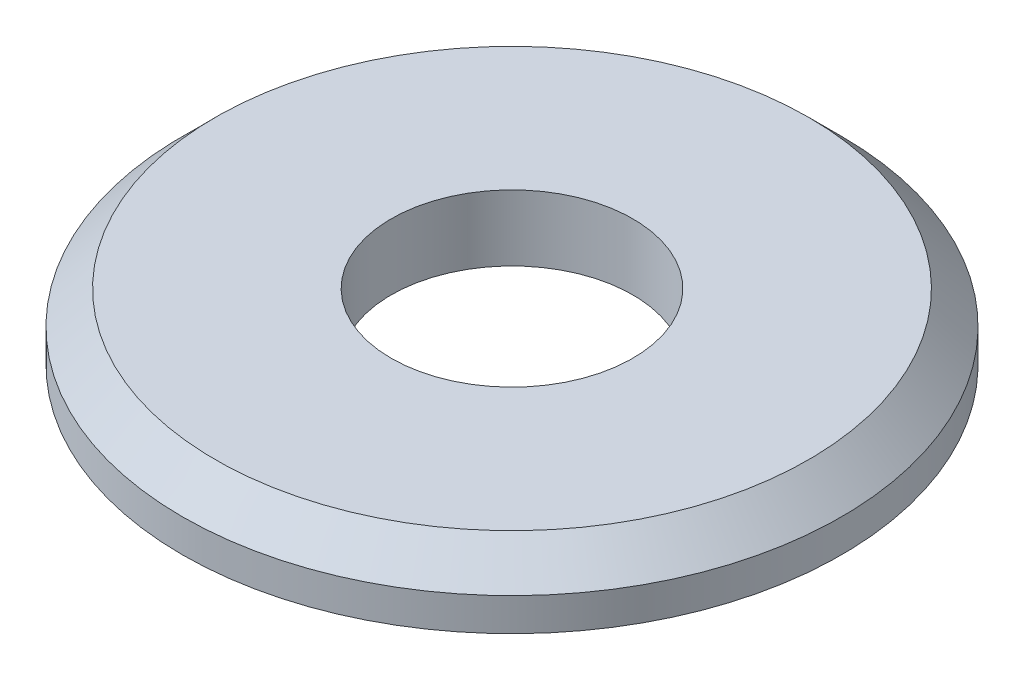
ISO-10303-21;
HEADER;
FILE_DESCRIPTION(('STEP AP214'),'2;1');
FILE_NAME('part.step','',(''),(''),'','','');
FILE_SCHEMA(('AUTOMOTIVE_DESIGN { 1 0 10303 214 1 1 1 1 }'));
ENDSEC;
DATA;
#1=APPLICATION_CONTEXT('core data for automotive mechanical design processes');
#2=APPLICATION_PROTOCOL_DEFINITION('international standard','automotive_design',2000,#1);
#3=PRODUCT_CONTEXT('',#1,'mechanical');
#4=PRODUCT('Part','Part','',(#3));
#5=PRODUCT_RELATED_PRODUCT_CATEGORY('part','',(#4));
#6=PRODUCT_DEFINITION_FORMATION('','',#4);
#7=PRODUCT_DEFINITION_CONTEXT('part definition',#1,'design');
#8=PRODUCT_DEFINITION('design','',#6,#7);
#9=PRODUCT_DEFINITION_SHAPE('','',#8);
#10=(LENGTH_UNIT() NAMED_UNIT(*) SI_UNIT(.MILLI.,.METRE.));
#11=(NAMED_UNIT(*) PLANE_ANGLE_UNIT() SI_UNIT($,.RADIAN.));
#12=(NAMED_UNIT(*) SI_UNIT($,.STERADIAN.) SOLID_ANGLE_UNIT());
#13=UNCERTAINTY_MEASURE_WITH_UNIT(LENGTH_MEASURE(1.E-05),#10,'distance_accuracy_value','');
#14=(GEOMETRIC_REPRESENTATION_CONTEXT(3) GLOBAL_UNCERTAINTY_ASSIGNED_CONTEXT((#13)) GLOBAL_UNIT_ASSIGNED_CONTEXT((#10,
#11,#12)) REPRESENTATION_CONTEXT('',''));
#15=CARTESIAN_POINT('',(0.,0.,0.));
#16=DIRECTION('',(0.,0.,1.));
#17=DIRECTION('',(1.,0.,0.));
#18=AXIS2_PLACEMENT_3D('',#15,#16,#17);
#19=CARTESIAN_POINT('',(0.,0.3,0.));
#20=DIRECTION('',(0.,1.,0.));
#21=DIRECTION('',(0.,0.,1.));
#22=AXIS2_PLACEMENT_3D('',#19,#20,#21);
#23=PLANE('',#22);
#24=CARTESIAN_POINT('',(0.,0.3,0.));
#25=DIRECTION('',(0.,1.,0.));
#26=DIRECTION('',(0.,0.,1.));
#27=AXIS2_PLACEMENT_3D('',#24,#25,#26);
#28=CIRCLE('',#27,1.35);
#29=CARTESIAN_POINT('',(0.,0.3,-1.35));
#30=VERTEX_POINT('',#29);
#31=EDGE_CURVE('E35',#30,#30,#28,.T.);
#32=ORIENTED_EDGE('',*,*,#31,.T.);
#33=EDGE_LOOP('',(#32));
#34=FACE_BOUND('',#33,.T.);
#35=CARTESIAN_POINT('',(0.,0.3,0.));
#36=DIRECTION('',(0.,1.,0.));
#37=DIRECTION('',(0.,0.,1.));
#38=AXIS2_PLACEMENT_3D('',#35,#36,#37);
#39=CIRCLE('',#38,0.55);
#40=CARTESIAN_POINT('',(0.,0.3,0.55));
#41=VERTEX_POINT('',#40);
#42=EDGE_CURVE('E43',#41,#41,#39,.T.);
#43=ORIENTED_EDGE('',*,*,#42,.F.);
#44=EDGE_LOOP('',(#43));
#45=FACE_BOUND('',#44,.T.);
#46=ADVANCED_FACE('F28',(#34,#45),#23,.T.);
#47=CARTESIAN_POINT('',(0.,0.,0.));
#48=DIRECTION('',(0.,1.,0.));
#49=DIRECTION('',(0.,0.,1.));
#50=AXIS2_PLACEMENT_3D('',#47,#48,#49);
#51=PLANE('',#50);
#52=CARTESIAN_POINT('',(0.,0.,0.));
#53=DIRECTION('',(0.,1.,0.));
#54=DIRECTION('',(0.,0.,1.));
#55=AXIS2_PLACEMENT_3D('',#52,#53,#54);
#56=CIRCLE('',#55,1.5);
#57=CARTESIAN_POINT('',(0.,0.,1.5));
#58=VERTEX_POINT('',#57);
#59=EDGE_CURVE('E39',#58,#58,#56,.T.);
#60=ORIENTED_EDGE('',*,*,#59,.F.);
#61=EDGE_LOOP('',(#60));
#62=FACE_BOUND('',#61,.T.);
#63=CARTESIAN_POINT('',(0.,0.,0.));
#64=DIRECTION('',(0.,1.,0.));
#65=DIRECTION('',(0.,0.,1.));
#66=AXIS2_PLACEMENT_3D('',#63,#64,#65);
#67=CIRCLE('',#66,0.55);
#68=CARTESIAN_POINT('',(0.,0.,0.55));
#69=VERTEX_POINT('',#68);
#70=EDGE_CURVE('E48',#69,#69,#67,.T.);
#71=ORIENTED_EDGE('',*,*,#70,.T.);
#72=EDGE_LOOP('',(#71));
#73=FACE_BOUND('',#72,.T.);
#74=ADVANCED_FACE('F52',(#62,#73),#51,.F.);
#75=CARTESIAN_POINT('',(0.,0.3,0.));
#76=DIRECTION('',(0.,-1.,0.));
#77=DIRECTION('',(0.,0.,-1.));
#78=AXIS2_PLACEMENT_3D('',#75,#76,#77);
#79=CYLINDRICAL_SURFACE('',#78,1.5);
#80=CARTESIAN_POINT('',(0.,0.150000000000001,0.));
#81=DIRECTION('',(0.,1.,0.));
#82=DIRECTION('',(0.,0.,1.));
#83=AXIS2_PLACEMENT_3D('',#80,#81,#82);
#84=CIRCLE('',#83,1.5);
#85=CARTESIAN_POINT('',(0.,0.150000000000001,-1.5));
#86=VERTEX_POINT('',#85);
#87=EDGE_CURVE('E10',#86,#86,#84,.F.);
#88=ORIENTED_EDGE('',*,*,#87,.T.);
#89=EDGE_LOOP('',(#88));
#90=FACE_BOUND('',#89,.T.);
#91=ORIENTED_EDGE('',*,*,#59,.T.);
#92=EDGE_LOOP('',(#91));
#93=FACE_BOUND('',#92,.T.);
#94=ADVANCED_FACE('F30',(#90,#93),#79,.T.);
#95=CARTESIAN_POINT('',(0.,0.3,0.));
#96=DIRECTION('',(0.,-1.,0.));
#97=DIRECTION('',(0.,0.,-1.));
#98=AXIS2_PLACEMENT_3D('',#95,#96,#97);
#99=CYLINDRICAL_SURFACE('',#98,0.55);
#100=ORIENTED_EDGE('',*,*,#42,.T.);
#101=EDGE_LOOP('',(#100));
#102=FACE_BOUND('',#101,.T.);
#103=ORIENTED_EDGE('',*,*,#70,.F.);
#104=EDGE_LOOP('',(#103));
#105=FACE_BOUND('',#104,.T.);
#106=ADVANCED_FACE('F54',(#102,#105),#99,.F.);
#107=CARTESIAN_POINT('',(0.,0.3,0.));
#108=DIRECTION('',(0.,-1.,0.));
#109=DIRECTION('',(0.,0.,-1.));
#110=AXIS2_PLACEMENT_3D('',#107,#108,#109);
#111=CONICAL_SURFACE('',#110,1.35,0.78539816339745);
#112=CARTESIAN_POINT('',(0.,0.150000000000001,-1.5));
#113=CARTESIAN_POINT('',(0.,0.151562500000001,-1.4984375));
#114=CARTESIAN_POINT('',(0.,0.153125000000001,-1.496875));
#115=CARTESIAN_POINT('',(0.,0.156250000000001,-1.49375));
#116=CARTESIAN_POINT('',(0.,0.157812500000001,-1.4921875));
#117=CARTESIAN_POINT('',(0.,0.160937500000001,-1.4890625));
#118=CARTESIAN_POINT('',(0.,0.162500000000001,-1.4875));
#119=CARTESIAN_POINT('',(0.,0.165625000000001,-1.484375));
#120=CARTESIAN_POINT('',(0.,0.167187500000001,-1.4828125));
#121=CARTESIAN_POINT('',(0.,0.170312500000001,-1.4796875));
#122=CARTESIAN_POINT('',(0.,0.171875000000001,-1.478125));
#123=CARTESIAN_POINT('',(0.,0.175,-1.475));
#124=CARTESIAN_POINT('',(0.,0.1765625,-1.4734375));
#125=CARTESIAN_POINT('',(0.,0.1796875,-1.4703125));
#126=CARTESIAN_POINT('',(0.,0.18125,-1.46875));
#127=CARTESIAN_POINT('',(0.,0.184375,-1.465625));
#128=CARTESIAN_POINT('',(0.,0.1859375,-1.4640625));
#129=CARTESIAN_POINT('',(0.,0.1890625,-1.4609375));
#130=CARTESIAN_POINT('',(0.,0.190625,-1.459375));
#131=CARTESIAN_POINT('',(0.,0.19375,-1.45625));
#132=CARTESIAN_POINT('',(0.,0.1953125,-1.4546875));
#133=CARTESIAN_POINT('',(0.,0.1984375,-1.4515625));
#134=CARTESIAN_POINT('',(0.,0.2,-1.45));
#135=CARTESIAN_POINT('',(0.,0.203125,-1.446875));
#136=CARTESIAN_POINT('',(0.,0.2046875,-1.4453125));
#137=CARTESIAN_POINT('',(0.,0.2078125,-1.4421875));
#138=CARTESIAN_POINT('',(0.,0.209375,-1.440625));
#139=CARTESIAN_POINT('',(0.,0.2125,-1.4375));
#140=CARTESIAN_POINT('',(0.,0.2140625,-1.4359375));
#141=CARTESIAN_POINT('',(0.,0.2171875,-1.4328125));
#142=CARTESIAN_POINT('',(0.,0.21875,-1.43125));
#143=CARTESIAN_POINT('',(0.,0.221875,-1.428125));
#144=CARTESIAN_POINT('',(0.,0.2234375,-1.4265625));
#145=CARTESIAN_POINT('',(0.,0.2265625,-1.4234375));
#146=CARTESIAN_POINT('',(0.,0.228125,-1.421875));
#147=CARTESIAN_POINT('',(0.,0.23125,-1.41875));
#148=CARTESIAN_POINT('',(0.,0.2328125,-1.4171875));
#149=CARTESIAN_POINT('',(0.,0.2359375,-1.4140625));
#150=CARTESIAN_POINT('',(0.,0.2375,-1.4125));
#151=CARTESIAN_POINT('',(0.,0.240625,-1.409375));
#152=CARTESIAN_POINT('',(0.,0.2421875,-1.4078125));
#153=CARTESIAN_POINT('',(0.,0.2453125,-1.4046875));
#154=CARTESIAN_POINT('',(0.,0.246875,-1.403125));
#155=CARTESIAN_POINT('',(0.,0.25,-1.4));
#156=CARTESIAN_POINT('',(0.,0.2515625,-1.3984375));
#157=CARTESIAN_POINT('',(0.,0.2546875,-1.3953125));
#158=CARTESIAN_POINT('',(0.,0.25625,-1.39375));
#159=CARTESIAN_POINT('',(0.,0.259375,-1.390625));
#160=CARTESIAN_POINT('',(0.,0.2609375,-1.3890625));
#161=CARTESIAN_POINT('',(0.,0.2640625,-1.3859375));
#162=CARTESIAN_POINT('',(0.,0.265625,-1.384375));
#163=CARTESIAN_POINT('',(0.,0.26875,-1.38125));
#164=CARTESIAN_POINT('',(0.,0.2703125,-1.3796875));
#165=CARTESIAN_POINT('',(0.,0.2734375,-1.3765625));
#166=CARTESIAN_POINT('',(0.,0.275,-1.375));
#167=CARTESIAN_POINT('',(0.,0.278125,-1.371875));
#168=CARTESIAN_POINT('',(0.,0.2796875,-1.3703125));
#169=CARTESIAN_POINT('',(0.,0.2828125,-1.3671875));
#170=CARTESIAN_POINT('',(0.,0.284375,-1.365625));
#171=CARTESIAN_POINT('',(0.,0.2875,-1.3625));
#172=CARTESIAN_POINT('',(0.,0.2890625,-1.3609375));
#173=CARTESIAN_POINT('',(0.,0.2921875,-1.3578125));
#174=CARTESIAN_POINT('',(0.,0.29375,-1.35625));
#175=CARTESIAN_POINT('',(0.,0.296875,-1.353125));
#176=CARTESIAN_POINT('',(0.,0.2984375,-1.3515625));
#177=CARTESIAN_POINT('',(0.,0.3,-1.35));
#178=B_SPLINE_CURVE_WITH_KNOTS('',3,(#112,#113,#114,#115,#116,#117,#118,#119,#120,#121,#122,
#123,#124,#125,#126,#127,#128,#129,#130,#131,#132,#133,#134,#135,#136,#137,#138,#139,#140,#141,
#142,#143,#144,#145,#146,#147,#148,#149,#150,#151,#152,#153,#154,#155,#156,#157,#158,#159,#160,
#161,#162,#163,#164,#165,#166,#167,#168,#169,#170,#171,#172,#173,#174,#175,#176,#177),
.UNSPECIFIED.,.F.,.F.,(4,2,2,2,2,2,2,2,2,2,2,2,2,2,2,2,2,2,2,2,2,2,2,2,2,2,2,2,2,2,2,2,4),(0.,
0.0066291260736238,0.0132582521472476,0.0198873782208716,0.0265165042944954,0.0331456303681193,
0.0397747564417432,0.046403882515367,0.0530330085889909,0.0596621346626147,0.0662912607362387,
0.0729203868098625,0.0795495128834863,0.0861786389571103,0.0928077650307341,0.0994368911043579,
0.106066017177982,0.112695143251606,0.11932426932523,0.125953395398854,0.132582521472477,
0.139211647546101,0.145840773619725,0.152469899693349,0.159099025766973,0.165728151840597,
0.172357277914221,0.178986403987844,0.185615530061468,0.192244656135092,0.198873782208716,
0.20550290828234,0.212132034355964),.UNSPECIFIED.);
#179=EDGE_CURVE('BSEAM56',#86,#30,#178,.T.);
#180=ORIENTED_EDGE('',*,*,#87,.F.);
#181=ORIENTED_EDGE('',*,*,#31,.F.);
#182=ORIENTED_EDGE('',*,*,#179,.T.);
#183=ORIENTED_EDGE('',*,*,#179,.F.);
#184=EDGE_LOOP('',(#180,#182,#181,#183));
#185=FACE_BOUND('',#184,.T.);
#186=ADVANCED_FACE('F56',(#185),#111,.T.);
#187=CLOSED_SHELL('',(#46,#74,#94,#106,#186));
#188=MANIFOLD_SOLID_BREP('B2',#187);
#189=ADVANCED_BREP_SHAPE_REPRESENTATION('',(#18,#188),#14);
#190=SHAPE_DEFINITION_REPRESENTATION(#9,#189);
ENDSEC;
END-ISO-10303-21;
